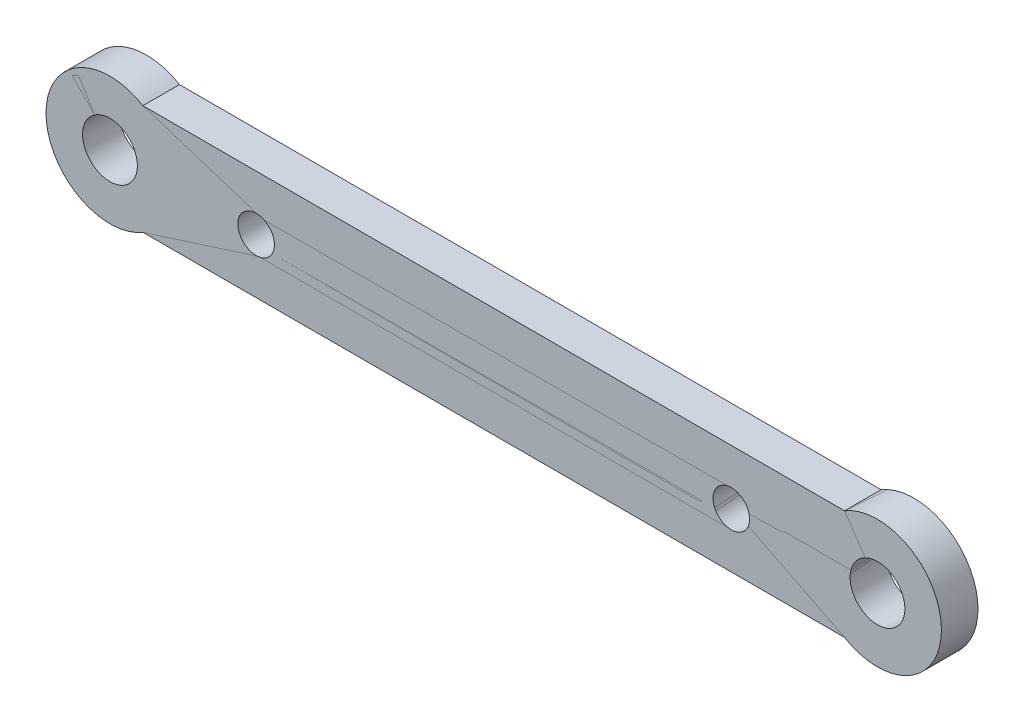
ISO-10303-21;
HEADER;
FILE_DESCRIPTION(('STEP AP214'),'2;1');
FILE_NAME('part.step','',(''),(''),'','','');
FILE_SCHEMA(('AUTOMOTIVE_DESIGN { 1 0 10303 214 1 1 1 1 }'));
ENDSEC;
DATA;
#1=APPLICATION_CONTEXT('core data for automotive mechanical design processes');
#2=APPLICATION_PROTOCOL_DEFINITION('international standard','automotive_design',2000,#1);
#3=PRODUCT_CONTEXT('',#1,'mechanical');
#4=PRODUCT('Part','Part','',(#3));
#5=PRODUCT_RELATED_PRODUCT_CATEGORY('part','',(#4));
#6=PRODUCT_DEFINITION_FORMATION('','',#4);
#7=PRODUCT_DEFINITION_CONTEXT('part definition',#1,'design');
#8=PRODUCT_DEFINITION('design','',#6,#7);
#9=PRODUCT_DEFINITION_SHAPE('','',#8);
#10=(LENGTH_UNIT() NAMED_UNIT(*) SI_UNIT(.MILLI.,.METRE.));
#11=(NAMED_UNIT(*) PLANE_ANGLE_UNIT() SI_UNIT($,.RADIAN.));
#12=(NAMED_UNIT(*) SI_UNIT($,.STERADIAN.) SOLID_ANGLE_UNIT());
#13=UNCERTAINTY_MEASURE_WITH_UNIT(LENGTH_MEASURE(1.E-05),#10,'distance_accuracy_value','');
#14=(GEOMETRIC_REPRESENTATION_CONTEXT(3) GLOBAL_UNCERTAINTY_ASSIGNED_CONTEXT((#13)) GLOBAL_UNIT_ASSIGNED_CONTEXT((#10,
#11,#12)) REPRESENTATION_CONTEXT('',''));
#15=CARTESIAN_POINT('',(0.,0.,0.));
#16=DIRECTION('',(0.,0.,1.));
#17=DIRECTION('',(1.,0.,0.));
#18=AXIS2_PLACEMENT_3D('',#15,#16,#17);
#19=CARTESIAN_POINT('',(1.59147860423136,8.46928198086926,-2.));
#20=DIRECTION('',(0.,0.,-1.));
#21=DIRECTION('',(-1.,0.,0.));
#22=AXIS2_PLACEMENT_3D('',#19,#20,#21);
#23=PLANE('',#22);
#24=CARTESIAN_POINT('',(-11.,13.,-2.));
#25=DIRECTION('',(0.,0.,1.));
#26=DIRECTION('',(1.,0.,0.));
#27=AXIS2_PLACEMENT_3D('',#24,#25,#26);
#28=CIRCLE('',#27,0.999999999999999);
#29=CARTESIAN_POINT('',(-10.,13.,-2.));
#30=VERTEX_POINT('',#29);
#31=EDGE_CURVE('P0_E437',#30,#30,#28,.F.);
#32=ORIENTED_EDGE('',*,*,#31,.F.);
#33=EDGE_LOOP('',(#32));
#34=FACE_BOUND('',#33,.T.);
#35=CARTESIAN_POINT('',(-37.,13.,-2.));
#36=DIRECTION('',(0.,0.,1.));
#37=DIRECTION('',(1.,0.,0.));
#38=AXIS2_PLACEMENT_3D('',#35,#36,#37);
#39=CIRCLE('',#38,0.999999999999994);
#40=CARTESIAN_POINT('',(-36.,13.,-2.));
#41=VERTEX_POINT('',#40);
#42=EDGE_CURVE('P0_E440',#41,#41,#39,.F.);
#43=ORIENTED_EDGE('',*,*,#42,.F.);
#44=EDGE_LOOP('',(#43));
#45=FACE_BOUND('',#44,.T.);
#46=CARTESIAN_POINT('',(-3.,13.,-2.));
#47=DIRECTION('',(0.,0.,-1.));
#48=DIRECTION('',(-1.,0.,0.));
#49=AXIS2_PLACEMENT_3D('',#46,#47,#48);
#50=CIRCLE('',#49,1.5);
#51=CARTESIAN_POINT('',(-4.5,13.,-2.));
#52=VERTEX_POINT('',#51);
#53=EDGE_CURVE('P0_E445',#52,#52,#50,.T.);
#54=ORIENTED_EDGE('',*,*,#53,.F.);
#55=EDGE_LOOP('',(#54));
#56=FACE_BOUND('',#55,.T.);
#57=CARTESIAN_POINT('',(-45.,13.,-2.));
#58=DIRECTION('',(0.,0.,-1.));
#59=DIRECTION('',(-1.,0.,0.));
#60=AXIS2_PLACEMENT_3D('',#57,#58,#59);
#61=CIRCLE('',#60,1.49999999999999);
#62=CARTESIAN_POINT('',(-46.5,13.,-2.));
#63=VERTEX_POINT('',#62);
#64=EDGE_CURVE('P0_E450',#63,#63,#61,.T.);
#65=ORIENTED_EDGE('',*,*,#64,.F.);
#66=EDGE_LOOP('',(#65));
#67=FACE_BOUND('',#66,.T.);
#68=CARTESIAN_POINT('',(-3.,13.,-2.));
#69=DIRECTION('',(0.,0.,1.));
#70=DIRECTION('',(1.,0.,0.));
#71=AXIS2_PLACEMENT_3D('',#68,#69,#70);
#72=CIRCLE('',#71,3.5);
#73=CARTESIAN_POINT('',(-4.802775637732,16.,-2.));
#74=VERTEX_POINT('',#73);
#75=CARTESIAN_POINT('',(-4.80277563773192,9.99999999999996,-2.));
#76=VERTEX_POINT('',#75);
#77=EDGE_CURVE('P0_E354',#74,#76,#72,.F.);
#78=ORIENTED_EDGE('',*,*,#77,.T.);
#79=DIRECTION('',(1.,0.,0.));
#80=VECTOR('',#79,1.);
#81=CARTESIAN_POINT('',(-24.,10.,-2.));
#82=LINE('',#81,#80);
#83=CARTESIAN_POINT('',(-43.1972243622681,9.99999999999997,-2.));
#84=VERTEX_POINT('',#83);
#85=EDGE_CURVE('P0_E393',#84,#76,#82,.T.);
#86=ORIENTED_EDGE('',*,*,#85,.F.);
#87=CARTESIAN_POINT('',(-45.,13.,-2.));
#88=DIRECTION('',(0.,0.,1.));
#89=DIRECTION('',(1.,0.,0.));
#90=AXIS2_PLACEMENT_3D('',#87,#88,#89);
#91=CIRCLE('',#90,3.5);
#92=CARTESIAN_POINT('',(-43.1972243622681,16.,-2.));
#93=VERTEX_POINT('',#92);
#94=EDGE_CURVE('P0_E456',#84,#93,#91,.F.);
#95=ORIENTED_EDGE('',*,*,#94,.T.);
#96=DIRECTION('',(-1.,0.,0.));
#97=VECTOR('',#96,1.);
#98=CARTESIAN_POINT('',(-24.,16.,-2.));
#99=LINE('',#98,#97);
#100=EDGE_CURVE('P0_E395',#74,#93,#99,.T.);
#101=ORIENTED_EDGE('',*,*,#100,.F.);
#102=EDGE_LOOP('',(#78,#86,#95,#101));
#103=FACE_BOUND('',#102,.T.);
#104=ADVANCED_FACE('P0_F350',(#34,#45,#56,#67,#103),#23,.T.);
#105=CARTESIAN_POINT('',(-43.197224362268,10.,0.));
#106=DIRECTION('',(0.,-1.,0.));
#107=DIRECTION('',(0.,0.,-1.));
#108=AXIS2_PLACEMENT_3D('',#105,#106,#107);
#109=PLANE('',#108);
#110=ORIENTED_EDGE('',*,*,#85,.T.);
#111=DIRECTION('',(0.,0.,1.));
#112=VECTOR('',#111,1.);
#113=CARTESIAN_POINT('',(-4.80277563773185,9.99999999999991,-1.));
#114=LINE('',#113,#112);
#115=CARTESIAN_POINT('',(-4.80277563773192,9.99999999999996,0.));
#116=VERTEX_POINT('',#115);
#117=EDGE_CURVE('P0_E397',#76,#116,#114,.T.);
#118=ORIENTED_EDGE('',*,*,#117,.T.);
#119=DIRECTION('',(1.,0.,0.));
#120=VECTOR('',#119,1.);
#121=CARTESIAN_POINT('',(-24.000000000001,10.,0.));
#122=LINE('',#121,#120);
#123=CARTESIAN_POINT('',(-43.1972243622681,9.99999999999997,0.));
#124=VERTEX_POINT('',#123);
#125=EDGE_CURVE('P0_E436',#124,#116,#122,.T.);
#126=ORIENTED_EDGE('',*,*,#125,.F.);
#127=DIRECTION('',(0.,0.,-1.));
#128=VECTOR('',#127,1.);
#129=CARTESIAN_POINT('',(-43.1972243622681,9.99999999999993,-1.));
#130=LINE('',#129,#128);
#131=EDGE_CURVE('P0_E402',#124,#84,#130,.T.);
#132=ORIENTED_EDGE('',*,*,#131,.T.);
#133=EDGE_LOOP('',(#110,#118,#126,#132));
#134=FACE_BOUND('',#133,.T.);
#135=ADVANCED_FACE('P0_F399',(#134),#109,.T.);
#136=CARTESIAN_POINT('',(-3.,13.,-2.));
#137=DIRECTION('',(0.,0.,1.));
#138=DIRECTION('',(1.,0.,0.));
#139=AXIS2_PLACEMENT_3D('',#136,#137,#138);
#140=CYLINDRICAL_SURFACE('',#139,3.5);
#141=ORIENTED_EDGE('',*,*,#117,.F.);
#142=ORIENTED_EDGE('',*,*,#77,.F.);
#143=DIRECTION('',(0.,0.,-1.));
#144=VECTOR('',#143,1.);
#145=CARTESIAN_POINT('',(-4.802775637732,16.,-19.197224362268));
#146=LINE('',#145,#144);
#147=CARTESIAN_POINT('',(-4.80277563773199,16.,0.));
#148=VERTEX_POINT('',#147);
#149=EDGE_CURVE('P0_E409',#148,#74,#146,.T.);
#150=ORIENTED_EDGE('',*,*,#149,.F.);
#151=CARTESIAN_POINT('',(-3.,13.,0.));
#152=DIRECTION('',(0.,0.,1.));
#153=DIRECTION('',(1.,0.,0.));
#154=AXIS2_PLACEMENT_3D('',#151,#152,#153);
#155=CIRCLE('',#154,3.5);
#156=EDGE_CURVE('P0_E407',#116,#148,#155,.T.);
#157=ORIENTED_EDGE('',*,*,#156,.F.);
#158=EDGE_LOOP('',(#141,#142,#150,#157));
#159=FACE_BOUND('',#158,.T.);
#160=ADVANCED_FACE('P0_F405',(#159),#140,.T.);
#161=CARTESIAN_POINT('',(-4.802775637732,16.,0.));
#162=DIRECTION('',(0.,1.,0.));
#163=DIRECTION('',(0.,0.,-1.));
#164=AXIS2_PLACEMENT_3D('',#161,#162,#163);
#165=PLANE('',#164);
#166=ORIENTED_EDGE('',*,*,#100,.T.);
#167=DIRECTION('',(0.,0.,1.));
#168=VECTOR('',#167,1.);
#169=CARTESIAN_POINT('',(-43.1972243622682,16.0000000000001,-1.));
#170=LINE('',#169,#168);
#171=CARTESIAN_POINT('',(-43.1972243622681,16.,0.));
#172=VERTEX_POINT('',#171);
#173=EDGE_CURVE('P0_E369',#93,#172,#170,.T.);
#174=ORIENTED_EDGE('',*,*,#173,.T.);
#175=DIRECTION('',(-1.,0.,0.));
#176=VECTOR('',#175,1.);
#177=CARTESIAN_POINT('',(-24.000000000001,16.,0.));
#178=LINE('',#177,#176);
#179=EDGE_CURVE('P0_E434',#148,#172,#178,.T.);
#180=ORIENTED_EDGE('',*,*,#179,.F.);
#181=ORIENTED_EDGE('',*,*,#149,.T.);
#182=EDGE_LOOP('',(#166,#174,#180,#181));
#183=FACE_BOUND('',#182,.T.);
#184=ADVANCED_FACE('P0_F462',(#183),#165,.T.);
#185=CARTESIAN_POINT('',(-45.,13.,-2.));
#186=DIRECTION('',(0.,0.,1.));
#187=DIRECTION('',(1.,0.,0.));
#188=AXIS2_PLACEMENT_3D('',#185,#186,#187);
#189=CYLINDRICAL_SURFACE('',#188,3.5);
#190=ORIENTED_EDGE('',*,*,#173,.F.);
#191=ORIENTED_EDGE('',*,*,#94,.F.);
#192=ORIENTED_EDGE('',*,*,#131,.F.);
#193=CARTESIAN_POINT('',(-45.,13.,0.));
#194=DIRECTION('',(0.,0.,1.));
#195=DIRECTION('',(1.,0.,0.));
#196=AXIS2_PLACEMENT_3D('',#193,#194,#195);
#197=CIRCLE('',#196,3.5);
#198=EDGE_CURVE('P0_E429',#172,#124,#197,.T.);
#199=ORIENTED_EDGE('',*,*,#198,.F.);
#200=EDGE_LOOP('',(#190,#191,#192,#199));
#201=FACE_BOUND('',#200,.T.);
#202=ADVANCED_FACE('P0_F464',(#201),#189,.T.);
#203=CARTESIAN_POINT('',(-45.,13.,0.));
#204=DIRECTION('',(0.,0.,-1.));
#205=DIRECTION('',(-1.,0.,0.));
#206=AXIS2_PLACEMENT_3D('',#203,#204,#205);
#207=CYLINDRICAL_SURFACE('',#206,1.49999999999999);
#208=ORIENTED_EDGE('',*,*,#64,.T.);
#209=EDGE_LOOP('',(#208));
#210=FACE_BOUND('',#209,.T.);
#211=CARTESIAN_POINT('',(-45.,13.,0.));
#212=DIRECTION('',(0.,0.,-1.));
#213=DIRECTION('',(-1.,0.,0.));
#214=AXIS2_PLACEMENT_3D('',#211,#212,#213);
#215=CIRCLE('',#214,1.49999999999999);
#216=CARTESIAN_POINT('',(-46.5,13.,0.));
#217=VERTEX_POINT('',#216);
#218=EDGE_CURVE('P0_E424',#217,#217,#215,.T.);
#219=ORIENTED_EDGE('',*,*,#218,.F.);
#220=EDGE_LOOP('',(#219));
#221=FACE_BOUND('',#220,.T.);
#222=ADVANCED_FACE('P0_F466',(#210,#221),#207,.F.);
#223=CARTESIAN_POINT('',(-3.,13.,0.));
#224=DIRECTION('',(0.,0.,-1.));
#225=DIRECTION('',(-1.,0.,0.));
#226=AXIS2_PLACEMENT_3D('',#223,#224,#225);
#227=CYLINDRICAL_SURFACE('',#226,1.5);
#228=ORIENTED_EDGE('',*,*,#53,.T.);
#229=EDGE_LOOP('',(#228));
#230=FACE_BOUND('',#229,.T.);
#231=CARTESIAN_POINT('',(-3.,13.,0.));
#232=DIRECTION('',(0.,0.,-1.));
#233=DIRECTION('',(-1.,0.,0.));
#234=AXIS2_PLACEMENT_3D('',#231,#232,#233);
#235=CIRCLE('',#234,1.5);
#236=CARTESIAN_POINT('',(-4.5,13.,0.));
#237=VERTEX_POINT('',#236);
#238=EDGE_CURVE('P0_E419',#237,#237,#235,.T.);
#239=ORIENTED_EDGE('',*,*,#238,.F.);
#240=EDGE_LOOP('',(#239));
#241=FACE_BOUND('',#240,.T.);
#242=ADVANCED_FACE('P0_F472',(#230,#241),#227,.F.);
#243=CARTESIAN_POINT('',(-37.,13.,-2.));
#244=DIRECTION('',(0.,0.,1.));
#245=DIRECTION('',(1.,0.,0.));
#246=AXIS2_PLACEMENT_3D('',#243,#244,#245);
#247=CYLINDRICAL_SURFACE('',#246,0.999999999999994);
#248=ORIENTED_EDGE('',*,*,#42,.T.);
#249=EDGE_LOOP('',(#248));
#250=FACE_BOUND('',#249,.T.);
#251=CARTESIAN_POINT('',(-37.,13.,0.));
#252=DIRECTION('',(0.,0.,1.));
#253=DIRECTION('',(1.,0.,0.));
#254=AXIS2_PLACEMENT_3D('',#251,#252,#253);
#255=CIRCLE('',#254,0.999999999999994);
#256=CARTESIAN_POINT('',(-36.,13.,0.));
#257=VERTEX_POINT('',#256);
#258=EDGE_CURVE('P0_E360',#257,#257,#255,.F.);
#259=ORIENTED_EDGE('',*,*,#258,.F.);
#260=EDGE_LOOP('',(#259));
#261=FACE_BOUND('',#260,.T.);
#262=ADVANCED_FACE('P0_F482',(#250,#261),#247,.F.);
#263=CARTESIAN_POINT('',(-11.,13.,-2.));
#264=DIRECTION('',(0.,0.,1.));
#265=DIRECTION('',(1.,0.,0.));
#266=AXIS2_PLACEMENT_3D('',#263,#264,#265);
#267=CYLINDRICAL_SURFACE('',#266,0.999999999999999);
#268=ORIENTED_EDGE('',*,*,#31,.T.);
#269=EDGE_LOOP('',(#268));
#270=FACE_BOUND('',#269,.T.);
#271=CARTESIAN_POINT('',(-11.,13.,0.));
#272=DIRECTION('',(0.,0.,1.));
#273=DIRECTION('',(1.,0.,0.));
#274=AXIS2_PLACEMENT_3D('',#271,#272,#273);
#275=CIRCLE('',#274,0.999999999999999);
#276=CARTESIAN_POINT('',(-10.,13.,0.));
#277=VERTEX_POINT('',#276);
#278=EDGE_CURVE('P0_E11',#277,#277,#275,.F.);
#279=ORIENTED_EDGE('',*,*,#278,.F.);
#280=EDGE_LOOP('',(#279));
#281=FACE_BOUND('',#280,.T.);
#282=ADVANCED_FACE('P0_F477',(#270,#281),#267,.F.);
#283=CARTESIAN_POINT('',(-49.5914786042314,8.46928198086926,0.));
#284=DIRECTION('',(0.,0.,1.));
#285=DIRECTION('',(1.,0.,0.));
#286=AXIS2_PLACEMENT_3D('',#283,#284,#285);
#287=PLANE('',#286);
#288=ORIENTED_EDGE('',*,*,#278,.T.);
#289=EDGE_LOOP('',(#288));
#290=FACE_BOUND('',#289,.T.);
#291=ORIENTED_EDGE('',*,*,#258,.T.);
#292=EDGE_LOOP('',(#291));
#293=FACE_BOUND('',#292,.T.);
#294=ORIENTED_EDGE('',*,*,#238,.T.);
#295=EDGE_LOOP('',(#294));
#296=FACE_BOUND('',#295,.T.);
#297=ORIENTED_EDGE('',*,*,#218,.T.);
#298=EDGE_LOOP('',(#297));
#299=FACE_BOUND('',#298,.T.);
#300=ORIENTED_EDGE('',*,*,#179,.T.);
#301=ORIENTED_EDGE('',*,*,#198,.T.);
#302=ORIENTED_EDGE('',*,*,#125,.T.);
#303=ORIENTED_EDGE('',*,*,#156,.T.);
#304=EDGE_LOOP('',(#300,#301,#302,#303));
#305=FACE_BOUND('',#304,.T.);
#306=ADVANCED_FACE('P0_F352',(#290,#293,#296,#299,#305),#287,.T.);
#307=CLOSED_SHELL('',(#104,#135,#160,#184,#202,#222,#242,#262,#282,#306));
#308=MANIFOLD_SOLID_BREP('P0_B2',#307);
#309=CARTESIAN_POINT('',(1.59147860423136,8.46928198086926,-2.));
#310=DIRECTION('',(0.,0.,-1.));
#311=DIRECTION('',(-1.,0.,0.));
#312=AXIS2_PLACEMENT_3D('',#309,#310,#311);
#313=PLANE('',#312);
#314=CARTESIAN_POINT('',(-11.,13.,-2.));
#315=DIRECTION('',(0.,0.,1.));
#316=DIRECTION('',(1.,0.,0.));
#317=AXIS2_PLACEMENT_3D('',#314,#315,#316);
#318=CIRCLE('',#317,0.999999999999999);
#319=CARTESIAN_POINT('',(-10.,13.,-2.));
#320=VERTEX_POINT('',#319);
#321=EDGE_CURVE('P1_E103',#320,#320,#318,.F.);
#322=ORIENTED_EDGE('',*,*,#321,.F.);
#323=EDGE_LOOP('',(#322));
#324=FACE_BOUND('',#323,.T.);
#325=CARTESIAN_POINT('',(-37.,13.,-2.));
#326=DIRECTION('',(0.,0.,1.));
#327=DIRECTION('',(1.,0.,0.));
#328=AXIS2_PLACEMENT_3D('',#325,#326,#327);
#329=CIRCLE('',#328,0.999999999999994);
#330=CARTESIAN_POINT('',(-36.,13.,-2.));
#331=VERTEX_POINT('',#330);
#332=EDGE_CURVE('P1_E106',#331,#331,#329,.F.);
#333=ORIENTED_EDGE('',*,*,#332,.F.);
#334=EDGE_LOOP('',(#333));
#335=FACE_BOUND('',#334,.T.);
#336=CARTESIAN_POINT('',(-3.,13.,-2.));
#337=DIRECTION('',(0.,0.,-1.));
#338=DIRECTION('',(-1.,0.,0.));
#339=AXIS2_PLACEMENT_3D('',#336,#337,#338);
#340=CIRCLE('',#339,1.5);
#341=CARTESIAN_POINT('',(-4.5,13.,-2.));
#342=VERTEX_POINT('',#341);
#343=EDGE_CURVE('P1_E111',#342,#342,#340,.T.);
#344=ORIENTED_EDGE('',*,*,#343,.F.);
#345=EDGE_LOOP('',(#344));
#346=FACE_BOUND('',#345,.T.);
#347=CARTESIAN_POINT('',(-45.,13.,-2.));
#348=DIRECTION('',(0.,0.,-1.));
#349=DIRECTION('',(-1.,0.,0.));
#350=AXIS2_PLACEMENT_3D('',#347,#348,#349);
#351=CIRCLE('',#350,1.49999999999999);
#352=CARTESIAN_POINT('',(-46.5,13.,-2.));
#353=VERTEX_POINT('',#352);
#354=EDGE_CURVE('P1_E116',#353,#353,#351,.T.);
#355=ORIENTED_EDGE('',*,*,#354,.F.);
#356=EDGE_LOOP('',(#355));
#357=FACE_BOUND('',#356,.T.);
#358=CARTESIAN_POINT('',(-3.,13.,-2.));
#359=DIRECTION('',(0.,0.,1.));
#360=DIRECTION('',(1.,0.,0.));
#361=AXIS2_PLACEMENT_3D('',#358,#359,#360);
#362=CIRCLE('',#361,3.5);
#363=CARTESIAN_POINT('',(-4.802775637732,16.,-2.));
#364=VERTEX_POINT('',#363);
#365=CARTESIAN_POINT('',(-4.80277563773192,9.99999999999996,-2.));
#366=VERTEX_POINT('',#365);
#367=EDGE_CURVE('P1_E20',#364,#366,#362,.F.);
#368=ORIENTED_EDGE('',*,*,#367,.T.);
#369=DIRECTION('',(1.,0.,0.));
#370=VECTOR('',#369,1.);
#371=CARTESIAN_POINT('',(-24.,10.,-2.));
#372=LINE('',#371,#370);
#373=CARTESIAN_POINT('',(-43.1972243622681,9.99999999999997,-2.));
#374=VERTEX_POINT('',#373);
#375=EDGE_CURVE('P1_E59',#374,#366,#372,.T.);
#376=ORIENTED_EDGE('',*,*,#375,.F.);
#377=CARTESIAN_POINT('',(-45.,13.,-2.));
#378=DIRECTION('',(0.,0.,1.));
#379=DIRECTION('',(1.,0.,0.));
#380=AXIS2_PLACEMENT_3D('',#377,#378,#379);
#381=CIRCLE('',#380,3.5);
#382=CARTESIAN_POINT('',(-43.1972243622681,16.,-2.));
#383=VERTEX_POINT('',#382);
#384=EDGE_CURVE('P1_E122',#374,#383,#381,.F.);
#385=ORIENTED_EDGE('',*,*,#384,.T.);
#386=DIRECTION('',(-1.,0.,0.));
#387=VECTOR('',#386,1.);
#388=CARTESIAN_POINT('',(-24.,16.,-2.));
#389=LINE('',#388,#387);
#390=EDGE_CURVE('P1_E61',#364,#383,#389,.T.);
#391=ORIENTED_EDGE('',*,*,#390,.F.);
#392=EDGE_LOOP('',(#368,#376,#385,#391));
#393=FACE_BOUND('',#392,.T.);
#394=ADVANCED_FACE('P1_F16',(#324,#335,#346,#357,#393),#313,.T.);
#395=CARTESIAN_POINT('',(-43.197224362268,10.,0.));
#396=DIRECTION('',(0.,-1.,0.));
#397=DIRECTION('',(0.,0.,-1.));
#398=AXIS2_PLACEMENT_3D('',#395,#396,#397);
#399=PLANE('',#398);
#400=ORIENTED_EDGE('',*,*,#375,.T.);
#401=DIRECTION('',(0.,0.,1.));
#402=VECTOR('',#401,1.);
#403=CARTESIAN_POINT('',(-4.80277563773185,9.99999999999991,-1.));
#404=LINE('',#403,#402);
#405=CARTESIAN_POINT('',(-4.80277563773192,9.99999999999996,0.));
#406=VERTEX_POINT('',#405);
#407=EDGE_CURVE('P1_E63',#366,#406,#404,.T.);
#408=ORIENTED_EDGE('',*,*,#407,.T.);
#409=DIRECTION('',(1.,0.,0.));
#410=VECTOR('',#409,1.);
#411=CARTESIAN_POINT('',(-24.000000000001,10.,0.));
#412=LINE('',#411,#410);
#413=CARTESIAN_POINT('',(-43.1972243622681,9.99999999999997,0.));
#414=VERTEX_POINT('',#413);
#415=EDGE_CURVE('P1_E102',#414,#406,#412,.T.);
#416=ORIENTED_EDGE('',*,*,#415,.F.);
#417=DIRECTION('',(0.,0.,-1.));
#418=VECTOR('',#417,1.);
#419=CARTESIAN_POINT('',(-43.1972243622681,9.99999999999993,-1.));
#420=LINE('',#419,#418);
#421=EDGE_CURVE('P1_E68',#414,#374,#420,.T.);
#422=ORIENTED_EDGE('',*,*,#421,.T.);
#423=EDGE_LOOP('',(#400,#408,#416,#422));
#424=FACE_BOUND('',#423,.T.);
#425=ADVANCED_FACE('P1_F65',(#424),#399,.T.);
#426=CARTESIAN_POINT('',(-3.,13.,-2.));
#427=DIRECTION('',(0.,0.,1.));
#428=DIRECTION('',(1.,0.,0.));
#429=AXIS2_PLACEMENT_3D('',#426,#427,#428);
#430=CYLINDRICAL_SURFACE('',#429,3.5);
#431=ORIENTED_EDGE('',*,*,#407,.F.);
#432=ORIENTED_EDGE('',*,*,#367,.F.);
#433=DIRECTION('',(0.,0.,-1.));
#434=VECTOR('',#433,1.);
#435=CARTESIAN_POINT('',(-4.802775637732,16.,-19.197224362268));
#436=LINE('',#435,#434);
#437=CARTESIAN_POINT('',(-4.80277563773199,16.,0.));
#438=VERTEX_POINT('',#437);
#439=EDGE_CURVE('P1_E75',#438,#364,#436,.T.);
#440=ORIENTED_EDGE('',*,*,#439,.F.);
#441=CARTESIAN_POINT('',(-3.,13.,0.));
#442=DIRECTION('',(0.,0.,1.));
#443=DIRECTION('',(1.,0.,0.));
#444=AXIS2_PLACEMENT_3D('',#441,#442,#443);
#445=CIRCLE('',#444,3.5);
#446=EDGE_CURVE('P1_E73',#406,#438,#445,.T.);
#447=ORIENTED_EDGE('',*,*,#446,.F.);
#448=EDGE_LOOP('',(#431,#432,#440,#447));
#449=FACE_BOUND('',#448,.T.);
#450=ADVANCED_FACE('P1_F71',(#449),#430,.T.);
#451=CARTESIAN_POINT('',(-4.802775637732,16.,0.));
#452=DIRECTION('',(0.,1.,0.));
#453=DIRECTION('',(0.,0.,-1.));
#454=AXIS2_PLACEMENT_3D('',#451,#452,#453);
#455=PLANE('',#454);
#456=ORIENTED_EDGE('',*,*,#390,.T.);
#457=DIRECTION('',(0.,0.,1.));
#458=VECTOR('',#457,1.);
#459=CARTESIAN_POINT('',(-43.1972243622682,16.0000000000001,-1.));
#460=LINE('',#459,#458);
#461=CARTESIAN_POINT('',(-43.1972243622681,16.,0.));
#462=VERTEX_POINT('',#461);
#463=EDGE_CURVE('P1_E35',#383,#462,#460,.T.);
#464=ORIENTED_EDGE('',*,*,#463,.T.);
#465=DIRECTION('',(-1.,0.,0.));
#466=VECTOR('',#465,1.);
#467=CARTESIAN_POINT('',(-24.000000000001,16.,0.));
#468=LINE('',#467,#466);
#469=EDGE_CURVE('P1_E100',#438,#462,#468,.T.);
#470=ORIENTED_EDGE('',*,*,#469,.F.);
#471=ORIENTED_EDGE('',*,*,#439,.T.);
#472=EDGE_LOOP('',(#456,#464,#470,#471));
#473=FACE_BOUND('',#472,.T.);
#474=ADVANCED_FACE('P1_F128',(#473),#455,.T.);
#475=CARTESIAN_POINT('',(-45.,13.,-2.));
#476=DIRECTION('',(0.,0.,1.));
#477=DIRECTION('',(1.,0.,0.));
#478=AXIS2_PLACEMENT_3D('',#475,#476,#477);
#479=CYLINDRICAL_SURFACE('',#478,3.5);
#480=ORIENTED_EDGE('',*,*,#463,.F.);
#481=ORIENTED_EDGE('',*,*,#384,.F.);
#482=ORIENTED_EDGE('',*,*,#421,.F.);
#483=CARTESIAN_POINT('',(-45.,13.,0.));
#484=DIRECTION('',(0.,0.,1.));
#485=DIRECTION('',(1.,0.,0.));
#486=AXIS2_PLACEMENT_3D('',#483,#484,#485);
#487=CIRCLE('',#486,3.5);
#488=EDGE_CURVE('P1_E95',#462,#414,#487,.T.);
#489=ORIENTED_EDGE('',*,*,#488,.F.);
#490=EDGE_LOOP('',(#480,#481,#482,#489));
#491=FACE_BOUND('',#490,.T.);
#492=ADVANCED_FACE('P1_F130',(#491),#479,.T.);
#493=CARTESIAN_POINT('',(-45.,13.,0.));
#494=DIRECTION('',(0.,0.,-1.));
#495=DIRECTION('',(-1.,0.,0.));
#496=AXIS2_PLACEMENT_3D('',#493,#494,#495);
#497=CYLINDRICAL_SURFACE('',#496,1.49999999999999);
#498=ORIENTED_EDGE('',*,*,#354,.T.);
#499=EDGE_LOOP('',(#498));
#500=FACE_BOUND('',#499,.T.);
#501=CARTESIAN_POINT('',(-45.,13.,0.));
#502=DIRECTION('',(0.,0.,-1.));
#503=DIRECTION('',(-1.,0.,0.));
#504=AXIS2_PLACEMENT_3D('',#501,#502,#503);
#505=CIRCLE('',#504,1.49999999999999);
#506=CARTESIAN_POINT('',(-46.5,13.,0.));
#507=VERTEX_POINT('',#506);
#508=EDGE_CURVE('P1_E90',#507,#507,#505,.T.);
#509=ORIENTED_EDGE('',*,*,#508,.F.);
#510=EDGE_LOOP('',(#509));
#511=FACE_BOUND('',#510,.T.);
#512=ADVANCED_FACE('P1_F131',(#500,#511),#497,.F.);
#513=CARTESIAN_POINT('',(-3.,13.,0.));
#514=DIRECTION('',(0.,0.,-1.));
#515=DIRECTION('',(-1.,0.,0.));
#516=AXIS2_PLACEMENT_3D('',#513,#514,#515);
#517=CYLINDRICAL_SURFACE('',#516,1.5);
#518=ORIENTED_EDGE('',*,*,#343,.T.);
#519=EDGE_LOOP('',(#518));
#520=FACE_BOUND('',#519,.T.);
#521=CARTESIAN_POINT('',(-3.,13.,0.));
#522=DIRECTION('',(0.,0.,-1.));
#523=DIRECTION('',(-1.,0.,0.));
#524=AXIS2_PLACEMENT_3D('',#521,#522,#523);
#525=CIRCLE('',#524,1.5);
#526=CARTESIAN_POINT('',(-4.5,13.,0.));
#527=VERTEX_POINT('',#526);
#528=EDGE_CURVE('P1_E85',#527,#527,#525,.T.);
#529=ORIENTED_EDGE('',*,*,#528,.F.);
#530=EDGE_LOOP('',(#529));
#531=FACE_BOUND('',#530,.T.);
#532=ADVANCED_FACE('P1_F133',(#520,#531),#517,.F.);
#533=CARTESIAN_POINT('',(-37.,13.,-2.));
#534=DIRECTION('',(0.,0.,1.));
#535=DIRECTION('',(1.,0.,0.));
#536=AXIS2_PLACEMENT_3D('',#533,#534,#535);
#537=CYLINDRICAL_SURFACE('',#536,0.999999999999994);
#538=ORIENTED_EDGE('',*,*,#332,.T.);
#539=EDGE_LOOP('',(#538));
#540=FACE_BOUND('',#539,.T.);
#541=CARTESIAN_POINT('',(-37.,13.,0.));
#542=DIRECTION('',(0.,0.,1.));
#543=DIRECTION('',(1.,0.,0.));
#544=AXIS2_PLACEMENT_3D('',#541,#542,#543);
#545=CIRCLE('',#544,0.999999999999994);
#546=CARTESIAN_POINT('',(-36.,13.,0.));
#547=VERTEX_POINT('',#546);
#548=EDGE_CURVE('P1_E26',#547,#547,#545,.F.);
#549=ORIENTED_EDGE('',*,*,#548,.F.);
#550=EDGE_LOOP('',(#549));
#551=FACE_BOUND('',#550,.T.);
#552=ADVANCED_FACE('P1_F139',(#540,#551),#537,.F.);
#553=CARTESIAN_POINT('',(-11.,13.,-2.));
#554=DIRECTION('',(0.,0.,1.));
#555=DIRECTION('',(1.,0.,0.));
#556=AXIS2_PLACEMENT_3D('',#553,#554,#555);
#557=CYLINDRICAL_SURFACE('',#556,0.999999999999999);
#558=ORIENTED_EDGE('',*,*,#321,.T.);
#559=EDGE_LOOP('',(#558));
#560=FACE_BOUND('',#559,.T.);
#561=CARTESIAN_POINT('',(-11.,13.,0.));
#562=DIRECTION('',(0.,0.,1.));
#563=DIRECTION('',(1.,0.,0.));
#564=AXIS2_PLACEMENT_3D('',#561,#562,#563);
#565=CIRCLE('',#564,0.999999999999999);
#566=CARTESIAN_POINT('',(-10.,13.,0.));
#567=VERTEX_POINT('',#566);
#568=EDGE_CURVE('P1_E10',#567,#567,#565,.F.);
#569=ORIENTED_EDGE('',*,*,#568,.F.);
#570=EDGE_LOOP('',(#569));
#571=FACE_BOUND('',#570,.T.);
#572=ADVANCED_FACE('P1_F137',(#560,#571),#557,.F.);
#573=CARTESIAN_POINT('',(-49.5914786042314,8.46928198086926,0.));
#574=DIRECTION('',(0.,0.,1.));
#575=DIRECTION('',(1.,0.,0.));
#576=AXIS2_PLACEMENT_3D('',#573,#574,#575);
#577=PLANE('',#576);
#578=ORIENTED_EDGE('',*,*,#568,.T.);
#579=EDGE_LOOP('',(#578));
#580=FACE_BOUND('',#579,.T.);
#581=ORIENTED_EDGE('',*,*,#548,.T.);
#582=EDGE_LOOP('',(#581));
#583=FACE_BOUND('',#582,.T.);
#584=ORIENTED_EDGE('',*,*,#528,.T.);
#585=EDGE_LOOP('',(#584));
#586=FACE_BOUND('',#585,.T.);
#587=ORIENTED_EDGE('',*,*,#508,.T.);
#588=EDGE_LOOP('',(#587));
#589=FACE_BOUND('',#588,.T.);
#590=ORIENTED_EDGE('',*,*,#469,.T.);
#591=ORIENTED_EDGE('',*,*,#488,.T.);
#592=ORIENTED_EDGE('',*,*,#415,.T.);
#593=ORIENTED_EDGE('',*,*,#446,.T.);
#594=EDGE_LOOP('',(#590,#591,#592,#593));
#595=FACE_BOUND('',#594,.T.);
#596=ADVANCED_FACE('P1_F18',(#580,#583,#586,#589,#595),#577,.T.);
#597=CLOSED_SHELL('',(#394,#425,#450,#474,#492,#512,#532,#552,#572,#596));
#598=MANIFOLD_SOLID_BREP('P1_B1',#597);
#599=ADVANCED_BREP_SHAPE_REPRESENTATION('',(#18,#308,#598),#14);
#600=SHAPE_DEFINITION_REPRESENTATION(#9,#599);
ENDSEC;
END-ISO-10303-21;
